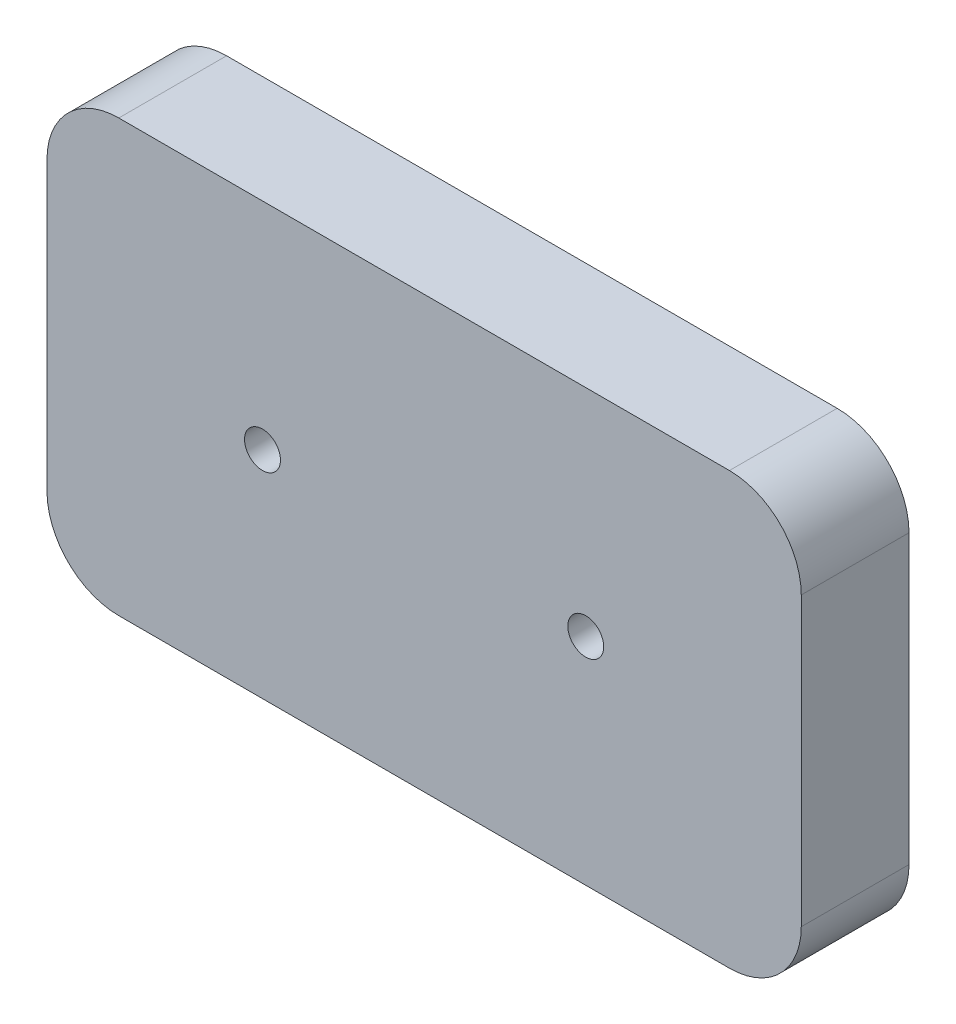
ISO-10303-21;
HEADER;
FILE_DESCRIPTION(('STEP AP214'),'2;1');
FILE_NAME('part.step','',(''),(''),'','','');
FILE_SCHEMA(('AUTOMOTIVE_DESIGN { 1 0 10303 214 1 1 1 1 }'));
ENDSEC;
DATA;
#1=APPLICATION_CONTEXT('core data for automotive mechanical design processes');
#2=APPLICATION_PROTOCOL_DEFINITION('international standard','automotive_design',2000,#1);
#3=PRODUCT_CONTEXT('',#1,'mechanical');
#4=PRODUCT('Part','Part','',(#3));
#5=PRODUCT_RELATED_PRODUCT_CATEGORY('part','',(#4));
#6=PRODUCT_DEFINITION_FORMATION('','',#4);
#7=PRODUCT_DEFINITION_CONTEXT('part definition',#1,'design');
#8=PRODUCT_DEFINITION('design','',#6,#7);
#9=PRODUCT_DEFINITION_SHAPE('','',#8);
#10=(LENGTH_UNIT() NAMED_UNIT(*) SI_UNIT(.MILLI.,.METRE.));
#11=(NAMED_UNIT(*) PLANE_ANGLE_UNIT() SI_UNIT($,.RADIAN.));
#12=(NAMED_UNIT(*) SI_UNIT($,.STERADIAN.) SOLID_ANGLE_UNIT());
#13=UNCERTAINTY_MEASURE_WITH_UNIT(LENGTH_MEASURE(1.E-05),#10,'distance_accuracy_value','');
#14=(GEOMETRIC_REPRESENTATION_CONTEXT(3) GLOBAL_UNCERTAINTY_ASSIGNED_CONTEXT((#13)) GLOBAL_UNIT_ASSIGNED_CONTEXT((#10,
#11,#12)) REPRESENTATION_CONTEXT('',''));
#15=CARTESIAN_POINT('',(0.,0.,0.));
#16=DIRECTION('',(0.,0.,1.));
#17=DIRECTION('',(1.,0.,0.));
#18=AXIS2_PLACEMENT_3D('',#15,#16,#17);
#19=CARTESIAN_POINT('',(-8.49999999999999,-4.,-3.));
#20=DIRECTION('',(0.,0.,1.));
#21=DIRECTION('',(1.,0.,0.));
#22=AXIS2_PLACEMENT_3D('',#19,#20,#21);
#23=CYLINDRICAL_SURFACE('',#22,2.);
#24=CARTESIAN_POINT('',(-8.49999999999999,-4.,0.));
#25=DIRECTION('',(0.,0.,1.));
#26=DIRECTION('',(-1.,0.,0.));
#27=AXIS2_PLACEMENT_3D('',#24,#25,#26);
#28=CIRCLE('',#27,2.);
#29=CARTESIAN_POINT('',(-10.5,-3.99999999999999,0.));
#30=VERTEX_POINT('',#29);
#31=CARTESIAN_POINT('',(-8.49999999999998,-6.,0.));
#32=VERTEX_POINT('',#31);
#33=EDGE_CURVE('E146',#30,#32,#28,.T.);
#34=ORIENTED_EDGE('',*,*,#33,.F.);
#35=DIRECTION('',(0.,0.,1.));
#36=VECTOR('',#35,1.);
#37=CARTESIAN_POINT('',(-10.5,-3.99999999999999,-3.));
#38=LINE('',#37,#36);
#39=CARTESIAN_POINT('',(-10.5,-3.99999999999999,-3.));
#40=VERTEX_POINT('',#39);
#41=EDGE_CURVE('E11',#40,#30,#38,.T.);
#42=ORIENTED_EDGE('',*,*,#41,.F.);
#43=CARTESIAN_POINT('',(-8.49999999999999,-4.,-3.));
#44=DIRECTION('',(0.,0.,1.));
#45=DIRECTION('',(-1.,0.,0.));
#46=AXIS2_PLACEMENT_3D('',#43,#44,#45);
#47=CIRCLE('',#46,2.);
#48=CARTESIAN_POINT('',(-8.49999999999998,-6.,-3.));
#49=VERTEX_POINT('',#48);
#50=EDGE_CURVE('E167',#40,#49,#47,.T.);
#51=ORIENTED_EDGE('',*,*,#50,.T.);
#52=DIRECTION('',(0.,0.,1.));
#53=VECTOR('',#52,1.);
#54=CARTESIAN_POINT('',(-8.49999999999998,-6.,-3.));
#55=LINE('',#54,#53);
#56=EDGE_CURVE('E39',#49,#32,#55,.T.);
#57=ORIENTED_EDGE('',*,*,#56,.T.);
#58=EDGE_LOOP('',(#34,#42,#51,#57));
#59=FACE_BOUND('',#58,.T.);
#60=ADVANCED_FACE('F36',(#59),#23,.T.);
#61=CARTESIAN_POINT('',(-10.5,-3.99999999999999,-3.));
#62=DIRECTION('',(-1.,0.,0.));
#63=DIRECTION('',(0.,0.,1.));
#64=AXIS2_PLACEMENT_3D('',#61,#62,#63);
#65=PLANE('',#64);
#66=DIRECTION('',(0.,-1.,0.));
#67=VECTOR('',#66,1.);
#68=CARTESIAN_POINT('',(-10.5,-3.99999999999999,0.));
#69=LINE('',#68,#67);
#70=CARTESIAN_POINT('',(-10.5,3.99999999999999,0.));
#71=VERTEX_POINT('',#70);
#72=EDGE_CURVE('E165',#71,#30,#69,.T.);
#73=ORIENTED_EDGE('',*,*,#72,.F.);
#74=DIRECTION('',(0.,0.,1.));
#75=VECTOR('',#74,1.);
#76=CARTESIAN_POINT('',(-10.5,3.99999999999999,-3.));
#77=LINE('',#76,#75);
#78=CARTESIAN_POINT('',(-10.5,3.99999999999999,-3.));
#79=VERTEX_POINT('',#78);
#80=EDGE_CURVE('E44',#79,#71,#77,.T.);
#81=ORIENTED_EDGE('',*,*,#80,.F.);
#82=DIRECTION('',(0.,-1.,0.));
#83=VECTOR('',#82,1.);
#84=CARTESIAN_POINT('',(-10.5,-3.99999999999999,-3.));
#85=LINE('',#84,#83);
#86=EDGE_CURVE('E136',#79,#40,#85,.T.);
#87=ORIENTED_EDGE('',*,*,#86,.T.);
#88=ORIENTED_EDGE('',*,*,#41,.T.);
#89=EDGE_LOOP('',(#73,#81,#87,#88));
#90=FACE_BOUND('',#89,.T.);
#91=ADVANCED_FACE('F179',(#90),#65,.T.);
#92=CARTESIAN_POINT('',(-8.49999999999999,4.,-3.));
#93=DIRECTION('',(0.,0.,1.));
#94=DIRECTION('',(1.,0.,0.));
#95=AXIS2_PLACEMENT_3D('',#92,#93,#94);
#96=CYLINDRICAL_SURFACE('',#95,2.);
#97=CARTESIAN_POINT('',(-8.49999999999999,4.,0.));
#98=DIRECTION('',(0.,0.,1.));
#99=DIRECTION('',(-1.,0.,0.));
#100=AXIS2_PLACEMENT_3D('',#97,#98,#99);
#101=CIRCLE('',#100,2.);
#102=CARTESIAN_POINT('',(-8.49999999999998,6.,0.));
#103=VERTEX_POINT('',#102);
#104=EDGE_CURVE('E123',#103,#71,#101,.T.);
#105=ORIENTED_EDGE('',*,*,#104,.F.);
#106=DIRECTION('',(0.,0.,1.));
#107=VECTOR('',#106,1.);
#108=CARTESIAN_POINT('',(-8.49999999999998,6.,-3.));
#109=LINE('',#108,#107);
#110=CARTESIAN_POINT('',(-8.49999999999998,6.,-3.));
#111=VERTEX_POINT('',#110);
#112=EDGE_CURVE('E117',#111,#103,#109,.T.);
#113=ORIENTED_EDGE('',*,*,#112,.F.);
#114=CARTESIAN_POINT('',(-8.49999999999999,4.,-3.));
#115=DIRECTION('',(0.,0.,1.));
#116=DIRECTION('',(-1.,0.,0.));
#117=AXIS2_PLACEMENT_3D('',#114,#115,#116);
#118=CIRCLE('',#117,2.);
#119=EDGE_CURVE('E120',#111,#79,#118,.T.);
#120=ORIENTED_EDGE('',*,*,#119,.T.);
#121=ORIENTED_EDGE('',*,*,#80,.T.);
#122=EDGE_LOOP('',(#105,#113,#120,#121));
#123=FACE_BOUND('',#122,.T.);
#124=ADVANCED_FACE('F119',(#123),#96,.T.);
#125=CARTESIAN_POINT('',(-8.49999999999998,6.,-3.));
#126=DIRECTION('',(0.,1.,0.));
#127=DIRECTION('',(0.,0.,1.));
#128=AXIS2_PLACEMENT_3D('',#125,#126,#127);
#129=PLANE('',#128);
#130=DIRECTION('',(-1.,0.,0.));
#131=VECTOR('',#130,1.);
#132=CARTESIAN_POINT('',(-8.49999999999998,6.,0.));
#133=LINE('',#132,#131);
#134=CARTESIAN_POINT('',(8.49999999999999,6.,0.));
#135=VERTEX_POINT('',#134);
#136=EDGE_CURVE('E162',#135,#103,#133,.T.);
#137=ORIENTED_EDGE('',*,*,#136,.F.);
#138=DIRECTION('',(0.,0.,1.));
#139=VECTOR('',#138,1.);
#140=CARTESIAN_POINT('',(8.49999999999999,6.,-3.));
#141=LINE('',#140,#139);
#142=CARTESIAN_POINT('',(8.49999999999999,6.,-3.));
#143=VERTEX_POINT('',#142);
#144=EDGE_CURVE('E128',#143,#135,#141,.T.);
#145=ORIENTED_EDGE('',*,*,#144,.F.);
#146=DIRECTION('',(-1.,0.,0.));
#147=VECTOR('',#146,1.);
#148=CARTESIAN_POINT('',(-8.49999999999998,6.,-3.));
#149=LINE('',#148,#147);
#150=EDGE_CURVE('E134',#143,#111,#149,.T.);
#151=ORIENTED_EDGE('',*,*,#150,.T.);
#152=ORIENTED_EDGE('',*,*,#112,.T.);
#153=EDGE_LOOP('',(#137,#145,#151,#152));
#154=FACE_BOUND('',#153,.T.);
#155=ADVANCED_FACE('F138',(#154),#129,.T.);
#156=CARTESIAN_POINT('',(8.50000000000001,4.,-3.));
#157=DIRECTION('',(0.,0.,1.));
#158=DIRECTION('',(1.,0.,0.));
#159=AXIS2_PLACEMENT_3D('',#156,#157,#158);
#160=CYLINDRICAL_SURFACE('',#159,2.);
#161=CARTESIAN_POINT('',(8.50000000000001,4.,0.));
#162=DIRECTION('',(0.,0.,1.));
#163=DIRECTION('',(-1.,0.,0.));
#164=AXIS2_PLACEMENT_3D('',#161,#162,#163);
#165=CIRCLE('',#164,2.);
#166=CARTESIAN_POINT('',(10.5,3.99999999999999,0.));
#167=VERTEX_POINT('',#166);
#168=EDGE_CURVE('E159',#167,#135,#165,.T.);
#169=ORIENTED_EDGE('',*,*,#168,.F.);
#170=DIRECTION('',(0.,0.,1.));
#171=VECTOR('',#170,1.);
#172=CARTESIAN_POINT('',(10.5,3.99999999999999,-3.));
#173=LINE('',#172,#171);
#174=CARTESIAN_POINT('',(10.5,3.99999999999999,-3.));
#175=VERTEX_POINT('',#174);
#176=EDGE_CURVE('E171',#175,#167,#173,.T.);
#177=ORIENTED_EDGE('',*,*,#176,.F.);
#178=CARTESIAN_POINT('',(8.50000000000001,4.,-3.));
#179=DIRECTION('',(0.,0.,1.));
#180=DIRECTION('',(-1.,0.,0.));
#181=AXIS2_PLACEMENT_3D('',#178,#179,#180);
#182=CIRCLE('',#181,2.);
#183=EDGE_CURVE('E139',#175,#143,#182,.T.);
#184=ORIENTED_EDGE('',*,*,#183,.T.);
#185=ORIENTED_EDGE('',*,*,#144,.T.);
#186=EDGE_LOOP('',(#169,#177,#184,#185));
#187=FACE_BOUND('',#186,.T.);
#188=ADVANCED_FACE('F192',(#187),#160,.T.);
#189=CARTESIAN_POINT('',(10.5,-3.99999999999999,-3.));
#190=DIRECTION('',(1.,0.,0.));
#191=DIRECTION('',(0.,0.,-1.));
#192=AXIS2_PLACEMENT_3D('',#189,#190,#191);
#193=PLANE('',#192);
#194=DIRECTION('',(0.,1.,0.));
#195=VECTOR('',#194,1.);
#196=CARTESIAN_POINT('',(10.5,-3.99999999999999,0.));
#197=LINE('',#196,#195);
#198=CARTESIAN_POINT('',(10.5,-3.99999999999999,0.));
#199=VERTEX_POINT('',#198);
#200=EDGE_CURVE('E156',#199,#167,#197,.T.);
#201=ORIENTED_EDGE('',*,*,#200,.F.);
#202=DIRECTION('',(0.,0.,1.));
#203=VECTOR('',#202,1.);
#204=CARTESIAN_POINT('',(10.5,-3.99999999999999,-3.));
#205=LINE('',#204,#203);
#206=CARTESIAN_POINT('',(10.5,-3.99999999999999,-3.));
#207=VERTEX_POINT('',#206);
#208=EDGE_CURVE('E173',#207,#199,#205,.T.);
#209=ORIENTED_EDGE('',*,*,#208,.F.);
#210=DIRECTION('',(0.,1.,0.));
#211=VECTOR('',#210,1.);
#212=CARTESIAN_POINT('',(10.5,-3.99999999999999,-3.));
#213=LINE('',#212,#211);
#214=EDGE_CURVE('E141',#207,#175,#213,.T.);
#215=ORIENTED_EDGE('',*,*,#214,.T.);
#216=ORIENTED_EDGE('',*,*,#176,.T.);
#217=EDGE_LOOP('',(#201,#209,#215,#216));
#218=FACE_BOUND('',#217,.T.);
#219=ADVANCED_FACE('F195',(#218),#193,.T.);
#220=CARTESIAN_POINT('',(8.50000000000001,-4.,-3.));
#221=DIRECTION('',(0.,0.,1.));
#222=DIRECTION('',(1.,0.,0.));
#223=AXIS2_PLACEMENT_3D('',#220,#221,#222);
#224=CYLINDRICAL_SURFACE('',#223,2.);
#225=CARTESIAN_POINT('',(8.50000000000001,-4.,0.));
#226=DIRECTION('',(0.,0.,1.));
#227=DIRECTION('',(1.,0.,0.));
#228=AXIS2_PLACEMENT_3D('',#225,#226,#227);
#229=CIRCLE('',#228,2.);
#230=CARTESIAN_POINT('',(8.49999999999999,-6.,0.));
#231=VERTEX_POINT('',#230);
#232=EDGE_CURVE('E153',#231,#199,#229,.T.);
#233=ORIENTED_EDGE('',*,*,#232,.F.);
#234=DIRECTION('',(0.,0.,1.));
#235=VECTOR('',#234,1.);
#236=CARTESIAN_POINT('',(8.49999999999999,-6.,-3.));
#237=LINE('',#236,#235);
#238=CARTESIAN_POINT('',(8.49999999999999,-6.,-3.));
#239=VERTEX_POINT('',#238);
#240=EDGE_CURVE('E174',#239,#231,#237,.T.);
#241=ORIENTED_EDGE('',*,*,#240,.F.);
#242=CARTESIAN_POINT('',(8.50000000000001,-4.,-3.));
#243=DIRECTION('',(0.,0.,1.));
#244=DIRECTION('',(1.,0.,0.));
#245=AXIS2_PLACEMENT_3D('',#242,#243,#244);
#246=CIRCLE('',#245,2.);
#247=EDGE_CURVE('E343',#239,#207,#246,.T.);
#248=ORIENTED_EDGE('',*,*,#247,.T.);
#249=ORIENTED_EDGE('',*,*,#208,.T.);
#250=EDGE_LOOP('',(#233,#241,#248,#249));
#251=FACE_BOUND('',#250,.T.);
#252=ADVANCED_FACE('F199',(#251),#224,.T.);
#253=CARTESIAN_POINT('',(-8.49999999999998,-6.,-3.));
#254=DIRECTION('',(0.,-1.,0.));
#255=DIRECTION('',(0.,0.,-1.));
#256=AXIS2_PLACEMENT_3D('',#253,#254,#255);
#257=PLANE('',#256);
#258=DIRECTION('',(1.,0.,0.));
#259=VECTOR('',#258,1.);
#260=CARTESIAN_POINT('',(-8.49999999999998,-6.,0.));
#261=LINE('',#260,#259);
#262=EDGE_CURVE('E149',#32,#231,#261,.T.);
#263=ORIENTED_EDGE('',*,*,#262,.F.);
#264=ORIENTED_EDGE('',*,*,#56,.F.);
#265=DIRECTION('',(1.,0.,0.));
#266=VECTOR('',#265,1.);
#267=CARTESIAN_POINT('',(-8.49999999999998,-6.,-3.));
#268=LINE('',#267,#266);
#269=EDGE_CURVE('E341',#49,#239,#268,.T.);
#270=ORIENTED_EDGE('',*,*,#269,.T.);
#271=ORIENTED_EDGE('',*,*,#240,.T.);
#272=EDGE_LOOP('',(#263,#264,#270,#271));
#273=FACE_BOUND('',#272,.T.);
#274=ADVANCED_FACE('F176',(#273),#257,.T.);
#275=CARTESIAN_POINT('',(-8.49999999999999,-4.,-3.));
#276=DIRECTION('',(0.,0.,-1.));
#277=DIRECTION('',(-1.,0.,0.));
#278=AXIS2_PLACEMENT_3D('',#275,#276,#277);
#279=PLANE('',#278);
#280=CARTESIAN_POINT('',(-8.5,4.,-3.));
#281=DIRECTION('',(0.,0.,-1.));
#282=DIRECTION('',(1.,0.,0.));
#283=AXIS2_PLACEMENT_3D('',#280,#281,#282);
#284=CIRCLE('',#283,1.);
#285=CARTESIAN_POINT('',(-9.5,3.99999999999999,-3.));
#286=VERTEX_POINT('',#285);
#287=CARTESIAN_POINT('',(-8.49999999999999,5.,-3.));
#288=VERTEX_POINT('',#287);
#289=EDGE_CURVE('E52',#286,#288,#284,.T.);
#290=ORIENTED_EDGE('',*,*,#289,.F.);
#291=DIRECTION('',(0.,1.,0.));
#292=VECTOR('',#291,1.);
#293=CARTESIAN_POINT('',(-9.5,-3.99999999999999,-3.));
#294=LINE('',#293,#292);
#295=CARTESIAN_POINT('',(-9.5,-3.99999999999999,-3.));
#296=VERTEX_POINT('',#295);
#297=EDGE_CURVE('E277',#296,#286,#294,.T.);
#298=ORIENTED_EDGE('',*,*,#297,.F.);
#299=CARTESIAN_POINT('',(-8.5,-4.,-3.));
#300=DIRECTION('',(0.,0.,-1.));
#301=DIRECTION('',(-1.,0.,0.));
#302=AXIS2_PLACEMENT_3D('',#299,#300,#301);
#303=CIRCLE('',#302,1.);
#304=CARTESIAN_POINT('',(-8.49999999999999,-5.,-3.));
#305=VERTEX_POINT('',#304);
#306=EDGE_CURVE('E315',#305,#296,#303,.T.);
#307=ORIENTED_EDGE('',*,*,#306,.F.);
#308=DIRECTION('',(-1.,0.,0.));
#309=VECTOR('',#308,1.);
#310=CARTESIAN_POINT('',(8.49999999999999,-5.,-3.));
#311=LINE('',#310,#309);
#312=CARTESIAN_POINT('',(8.49999999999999,-5.,-3.));
#313=VERTEX_POINT('',#312);
#314=EDGE_CURVE('E312',#313,#305,#311,.T.);
#315=ORIENTED_EDGE('',*,*,#314,.F.);
#316=CARTESIAN_POINT('',(8.5,-4.,-3.));
#317=DIRECTION('',(0.,0.,-1.));
#318=DIRECTION('',(1.,0.,0.));
#319=AXIS2_PLACEMENT_3D('',#316,#317,#318);
#320=CIRCLE('',#319,1.);
#321=CARTESIAN_POINT('',(9.5,-3.99999999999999,-3.));
#322=VERTEX_POINT('',#321);
#323=EDGE_CURVE('E309',#322,#313,#320,.T.);
#324=ORIENTED_EDGE('',*,*,#323,.F.);
#325=DIRECTION('',(0.,-1.,0.));
#326=VECTOR('',#325,1.);
#327=CARTESIAN_POINT('',(9.5,-3.99999999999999,-3.));
#328=LINE('',#327,#326);
#329=CARTESIAN_POINT('',(9.5,3.99999999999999,-3.));
#330=VERTEX_POINT('',#329);
#331=EDGE_CURVE('E306',#330,#322,#328,.T.);
#332=ORIENTED_EDGE('',*,*,#331,.F.);
#333=CARTESIAN_POINT('',(8.5,4.,-3.));
#334=DIRECTION('',(0.,0.,-1.));
#335=DIRECTION('',(1.,0.,0.));
#336=AXIS2_PLACEMENT_3D('',#333,#334,#335);
#337=CIRCLE('',#336,1.);
#338=CARTESIAN_POINT('',(8.49999999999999,5.,-3.));
#339=VERTEX_POINT('',#338);
#340=EDGE_CURVE('E303',#339,#330,#337,.T.);
#341=ORIENTED_EDGE('',*,*,#340,.F.);
#342=DIRECTION('',(1.,0.,0.));
#343=VECTOR('',#342,1.);
#344=CARTESIAN_POINT('',(8.49999999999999,5.,-3.));
#345=LINE('',#344,#343);
#346=EDGE_CURVE('E300',#288,#339,#345,.T.);
#347=ORIENTED_EDGE('',*,*,#346,.F.);
#348=EDGE_LOOP('',(#290,#298,#307,#315,#324,#332,#341,#347));
#349=FACE_BOUND('',#348,.T.);
#350=ORIENTED_EDGE('',*,*,#50,.F.);
#351=ORIENTED_EDGE('',*,*,#86,.F.);
#352=ORIENTED_EDGE('',*,*,#119,.F.);
#353=ORIENTED_EDGE('',*,*,#150,.F.);
#354=ORIENTED_EDGE('',*,*,#183,.F.);
#355=ORIENTED_EDGE('',*,*,#214,.F.);
#356=ORIENTED_EDGE('',*,*,#247,.F.);
#357=ORIENTED_EDGE('',*,*,#269,.F.);
#358=EDGE_LOOP('',(#350,#351,#352,#353,#354,#355,#356,#357));
#359=FACE_BOUND('',#358,.T.);
#360=ADVANCED_FACE('F132',(#349,#359),#279,.T.);
#361=CARTESIAN_POINT('',(-8.49999999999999,-4.,0.));
#362=DIRECTION('',(0.,0.,-1.));
#363=DIRECTION('',(-1.,0.,0.));
#364=AXIS2_PLACEMENT_3D('',#361,#362,#363);
#365=PLANE('',#364);
#366=CARTESIAN_POINT('',(4.5,0.,0.));
#367=DIRECTION('',(0.,0.,-1.));
#368=DIRECTION('',(-1.,0.,0.));
#369=AXIS2_PLACEMENT_3D('',#366,#367,#368);
#370=CIRCLE('',#369,0.500000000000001);
#371=CARTESIAN_POINT('',(4.,0.,0.));
#372=VERTEX_POINT('',#371);
#373=EDGE_CURVE('E260',#372,#372,#370,.T.);
#374=ORIENTED_EDGE('',*,*,#373,.T.);
#375=EDGE_LOOP('',(#374));
#376=FACE_BOUND('',#375,.T.);
#377=CARTESIAN_POINT('',(-4.5,0.,0.));
#378=DIRECTION('',(0.,0.,-1.));
#379=DIRECTION('',(-1.,0.,0.));
#380=AXIS2_PLACEMENT_3D('',#377,#378,#379);
#381=CIRCLE('',#380,0.500000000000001);
#382=CARTESIAN_POINT('',(-5.,0.,0.));
#383=VERTEX_POINT('',#382);
#384=EDGE_CURVE('E268',#383,#383,#381,.T.);
#385=ORIENTED_EDGE('',*,*,#384,.T.);
#386=EDGE_LOOP('',(#385));
#387=FACE_BOUND('',#386,.T.);
#388=ORIENTED_EDGE('',*,*,#33,.T.);
#389=ORIENTED_EDGE('',*,*,#262,.T.);
#390=ORIENTED_EDGE('',*,*,#232,.T.);
#391=ORIENTED_EDGE('',*,*,#200,.T.);
#392=ORIENTED_EDGE('',*,*,#168,.T.);
#393=ORIENTED_EDGE('',*,*,#136,.T.);
#394=ORIENTED_EDGE('',*,*,#104,.T.);
#395=ORIENTED_EDGE('',*,*,#72,.T.);
#396=EDGE_LOOP('',(#388,#389,#390,#391,#392,#393,#394,#395));
#397=FACE_BOUND('',#396,.T.);
#398=ADVANCED_FACE('F178',(#376,#387,#397),#365,.F.);
#399=CARTESIAN_POINT('',(-8.5,4.,-1.3));
#400=DIRECTION('',(0.,0.,-1.));
#401=DIRECTION('',(-1.,0.,0.));
#402=AXIS2_PLACEMENT_3D('',#399,#400,#401);
#403=CYLINDRICAL_SURFACE('',#402,1.);
#404=ORIENTED_EDGE('',*,*,#289,.T.);
#405=DIRECTION('',(0.,0.,-1.));
#406=VECTOR('',#405,1.);
#407=CARTESIAN_POINT('',(-8.49999999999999,5.,-1.3));
#408=LINE('',#407,#406);
#409=CARTESIAN_POINT('',(-8.49999999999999,5.,-1.3));
#410=VERTEX_POINT('',#409);
#411=EDGE_CURVE('E298',#410,#288,#408,.T.);
#412=ORIENTED_EDGE('',*,*,#411,.F.);
#413=CARTESIAN_POINT('',(-8.5,4.,-1.3));
#414=DIRECTION('',(0.,0.,-1.));
#415=DIRECTION('',(1.,0.,0.));
#416=AXIS2_PLACEMENT_3D('',#413,#414,#415);
#417=CIRCLE('',#416,1.);
#418=CARTESIAN_POINT('',(-9.5,3.99999999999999,-1.3));
#419=VERTEX_POINT('',#418);
#420=EDGE_CURVE('E273',#419,#410,#417,.T.);
#421=ORIENTED_EDGE('',*,*,#420,.F.);
#422=DIRECTION('',(0.,0.,-1.));
#423=VECTOR('',#422,1.);
#424=CARTESIAN_POINT('',(-9.5,3.99999999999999,-1.3));
#425=LINE('',#424,#423);
#426=EDGE_CURVE('E150',#419,#286,#425,.T.);
#427=ORIENTED_EDGE('',*,*,#426,.T.);
#428=EDGE_LOOP('',(#404,#412,#421,#427));
#429=FACE_BOUND('',#428,.T.);
#430=ADVANCED_FACE('F211',(#429),#403,.F.);
#431=CARTESIAN_POINT('',(-9.5,-3.99999999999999,-1.3));
#432=DIRECTION('',(-1.,0.,0.));
#433=DIRECTION('',(0.,0.,1.));
#434=AXIS2_PLACEMENT_3D('',#431,#432,#433);
#435=PLANE('',#434);
#436=ORIENTED_EDGE('',*,*,#297,.T.);
#437=ORIENTED_EDGE('',*,*,#426,.F.);
#438=DIRECTION('',(0.,1.,0.));
#439=VECTOR('',#438,1.);
#440=CARTESIAN_POINT('',(-9.5,-3.99999999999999,-1.3));
#441=LINE('',#440,#439);
#442=CARTESIAN_POINT('',(-9.5,-3.99999999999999,-1.3));
#443=VERTEX_POINT('',#442);
#444=EDGE_CURVE('E295',#443,#419,#441,.T.);
#445=ORIENTED_EDGE('',*,*,#444,.F.);
#446=DIRECTION('',(0.,0.,-1.));
#447=VECTOR('',#446,1.);
#448=CARTESIAN_POINT('',(-9.5,-3.99999999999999,-1.3));
#449=LINE('',#448,#447);
#450=EDGE_CURVE('E321',#443,#296,#449,.T.);
#451=ORIENTED_EDGE('',*,*,#450,.T.);
#452=EDGE_LOOP('',(#436,#437,#445,#451));
#453=FACE_BOUND('',#452,.T.);
#454=ADVANCED_FACE('F216',(#453),#435,.F.);
#455=CARTESIAN_POINT('',(-8.5,-4.,-1.3));
#456=DIRECTION('',(0.,0.,-1.));
#457=DIRECTION('',(-1.,0.,0.));
#458=AXIS2_PLACEMENT_3D('',#455,#456,#457);
#459=CYLINDRICAL_SURFACE('',#458,1.);
#460=ORIENTED_EDGE('',*,*,#306,.T.);
#461=ORIENTED_EDGE('',*,*,#450,.F.);
#462=CARTESIAN_POINT('',(-8.5,-4.,-1.3));
#463=DIRECTION('',(0.,0.,-1.));
#464=DIRECTION('',(-1.,0.,0.));
#465=AXIS2_PLACEMENT_3D('',#462,#463,#464);
#466=CIRCLE('',#465,1.);
#467=CARTESIAN_POINT('',(-8.49999999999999,-5.,-1.3));
#468=VERTEX_POINT('',#467);
#469=EDGE_CURVE('E292',#468,#443,#466,.T.);
#470=ORIENTED_EDGE('',*,*,#469,.F.);
#471=DIRECTION('',(0.,0.,-1.));
#472=VECTOR('',#471,1.);
#473=CARTESIAN_POINT('',(-8.49999999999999,-5.,-1.3));
#474=LINE('',#473,#472);
#475=EDGE_CURVE('E324',#468,#305,#474,.T.);
#476=ORIENTED_EDGE('',*,*,#475,.T.);
#477=EDGE_LOOP('',(#460,#461,#470,#476));
#478=FACE_BOUND('',#477,.T.);
#479=ADVANCED_FACE('F237',(#478),#459,.F.);
#480=CARTESIAN_POINT('',(8.49999999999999,-5.,-1.3));
#481=DIRECTION('',(0.,-1.,0.));
#482=DIRECTION('',(0.,0.,-1.));
#483=AXIS2_PLACEMENT_3D('',#480,#481,#482);
#484=PLANE('',#483);
#485=ORIENTED_EDGE('',*,*,#314,.T.);
#486=ORIENTED_EDGE('',*,*,#475,.F.);
#487=DIRECTION('',(-1.,0.,0.));
#488=VECTOR('',#487,1.);
#489=CARTESIAN_POINT('',(8.49999999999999,-5.,-1.3));
#490=LINE('',#489,#488);
#491=CARTESIAN_POINT('',(8.49999999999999,-5.,-1.3));
#492=VERTEX_POINT('',#491);
#493=EDGE_CURVE('E289',#492,#468,#490,.T.);
#494=ORIENTED_EDGE('',*,*,#493,.F.);
#495=DIRECTION('',(0.,0.,-1.));
#496=VECTOR('',#495,1.);
#497=CARTESIAN_POINT('',(8.49999999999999,-5.,-1.3));
#498=LINE('',#497,#496);
#499=EDGE_CURVE('E327',#492,#313,#498,.T.);
#500=ORIENTED_EDGE('',*,*,#499,.T.);
#501=EDGE_LOOP('',(#485,#486,#494,#500));
#502=FACE_BOUND('',#501,.T.);
#503=ADVANCED_FACE('F233',(#502),#484,.F.);
#504=CARTESIAN_POINT('',(8.5,-4.,-1.3));
#505=DIRECTION('',(0.,0.,-1.));
#506=DIRECTION('',(-1.,0.,0.));
#507=AXIS2_PLACEMENT_3D('',#504,#505,#506);
#508=CYLINDRICAL_SURFACE('',#507,1.);
#509=ORIENTED_EDGE('',*,*,#323,.T.);
#510=ORIENTED_EDGE('',*,*,#499,.F.);
#511=CARTESIAN_POINT('',(8.5,-4.,-1.3));
#512=DIRECTION('',(0.,0.,-1.));
#513=DIRECTION('',(1.,0.,0.));
#514=AXIS2_PLACEMENT_3D('',#511,#512,#513);
#515=CIRCLE('',#514,1.);
#516=CARTESIAN_POINT('',(9.5,-3.99999999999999,-1.3));
#517=VERTEX_POINT('',#516);
#518=EDGE_CURVE('E286',#517,#492,#515,.T.);
#519=ORIENTED_EDGE('',*,*,#518,.F.);
#520=DIRECTION('',(0.,0.,-1.));
#521=VECTOR('',#520,1.);
#522=CARTESIAN_POINT('',(9.5,-3.99999999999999,-1.3));
#523=LINE('',#522,#521);
#524=EDGE_CURVE('E330',#517,#322,#523,.T.);
#525=ORIENTED_EDGE('',*,*,#524,.T.);
#526=EDGE_LOOP('',(#509,#510,#519,#525));
#527=FACE_BOUND('',#526,.T.);
#528=ADVANCED_FACE('F229',(#527),#508,.F.);
#529=CARTESIAN_POINT('',(9.5,-3.99999999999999,-1.3));
#530=DIRECTION('',(1.,0.,0.));
#531=DIRECTION('',(0.,0.,-1.));
#532=AXIS2_PLACEMENT_3D('',#529,#530,#531);
#533=PLANE('',#532);
#534=ORIENTED_EDGE('',*,*,#331,.T.);
#535=ORIENTED_EDGE('',*,*,#524,.F.);
#536=DIRECTION('',(0.,-1.,0.));
#537=VECTOR('',#536,1.);
#538=CARTESIAN_POINT('',(9.5,-3.99999999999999,-1.3));
#539=LINE('',#538,#537);
#540=CARTESIAN_POINT('',(9.5,3.99999999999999,-1.3));
#541=VERTEX_POINT('',#540);
#542=EDGE_CURVE('E283',#541,#517,#539,.T.);
#543=ORIENTED_EDGE('',*,*,#542,.F.);
#544=DIRECTION('',(0.,0.,-1.));
#545=VECTOR('',#544,1.);
#546=CARTESIAN_POINT('',(9.5,3.99999999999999,-1.3));
#547=LINE('',#546,#545);
#548=EDGE_CURVE('E333',#541,#330,#547,.T.);
#549=ORIENTED_EDGE('',*,*,#548,.T.);
#550=EDGE_LOOP('',(#534,#535,#543,#549));
#551=FACE_BOUND('',#550,.T.);
#552=ADVANCED_FACE('F225',(#551),#533,.F.);
#553=CARTESIAN_POINT('',(8.5,4.,-1.3));
#554=DIRECTION('',(0.,0.,-1.));
#555=DIRECTION('',(-1.,0.,0.));
#556=AXIS2_PLACEMENT_3D('',#553,#554,#555);
#557=CYLINDRICAL_SURFACE('',#556,1.);
#558=ORIENTED_EDGE('',*,*,#340,.T.);
#559=ORIENTED_EDGE('',*,*,#548,.F.);
#560=CARTESIAN_POINT('',(8.5,4.,-1.3));
#561=DIRECTION('',(0.,0.,-1.));
#562=DIRECTION('',(1.,0.,0.));
#563=AXIS2_PLACEMENT_3D('',#560,#561,#562);
#564=CIRCLE('',#563,1.);
#565=CARTESIAN_POINT('',(8.49999999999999,5.,-1.3));
#566=VERTEX_POINT('',#565);
#567=EDGE_CURVE('E280',#566,#541,#564,.T.);
#568=ORIENTED_EDGE('',*,*,#567,.F.);
#569=DIRECTION('',(0.,0.,-1.));
#570=VECTOR('',#569,1.);
#571=CARTESIAN_POINT('',(8.49999999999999,5.,-1.3));
#572=LINE('',#571,#570);
#573=EDGE_CURVE('E336',#566,#339,#572,.T.);
#574=ORIENTED_EDGE('',*,*,#573,.T.);
#575=EDGE_LOOP('',(#558,#559,#568,#574));
#576=FACE_BOUND('',#575,.T.);
#577=ADVANCED_FACE('F221',(#576),#557,.F.);
#578=CARTESIAN_POINT('',(8.49999999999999,5.,-1.3));
#579=DIRECTION('',(0.,1.,0.));
#580=DIRECTION('',(0.,0.,1.));
#581=AXIS2_PLACEMENT_3D('',#578,#579,#580);
#582=PLANE('',#581);
#583=ORIENTED_EDGE('',*,*,#346,.T.);
#584=ORIENTED_EDGE('',*,*,#573,.F.);
#585=DIRECTION('',(1.,0.,0.));
#586=VECTOR('',#585,1.);
#587=CARTESIAN_POINT('',(8.49999999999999,5.,-1.3));
#588=LINE('',#587,#586);
#589=EDGE_CURVE('E276',#410,#566,#588,.T.);
#590=ORIENTED_EDGE('',*,*,#589,.F.);
#591=ORIENTED_EDGE('',*,*,#411,.T.);
#592=EDGE_LOOP('',(#583,#584,#590,#591));
#593=FACE_BOUND('',#592,.T.);
#594=ADVANCED_FACE('F217',(#593),#582,.F.);
#595=CARTESIAN_POINT('',(-8.5,4.,-1.3));
#596=DIRECTION('',(0.,0.,1.));
#597=DIRECTION('',(1.,0.,0.));
#598=AXIS2_PLACEMENT_3D('',#595,#596,#597);
#599=PLANE('',#598);
#600=CARTESIAN_POINT('',(4.5,0.,-1.3));
#601=DIRECTION('',(0.,0.,-1.));
#602=DIRECTION('',(-1.,0.,0.));
#603=AXIS2_PLACEMENT_3D('',#600,#601,#602);
#604=CIRCLE('',#603,0.500000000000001);
#605=CARTESIAN_POINT('',(4.,0.,-1.3));
#606=VERTEX_POINT('',#605);
#607=EDGE_CURVE('E263',#606,#606,#604,.T.);
#608=ORIENTED_EDGE('',*,*,#607,.F.);
#609=EDGE_LOOP('',(#608));
#610=FACE_BOUND('',#609,.T.);
#611=CARTESIAN_POINT('',(-4.5,0.,-1.3));
#612=DIRECTION('',(0.,0.,-1.));
#613=DIRECTION('',(-1.,0.,0.));
#614=AXIS2_PLACEMENT_3D('',#611,#612,#613);
#615=CIRCLE('',#614,0.500000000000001);
#616=CARTESIAN_POINT('',(-5.,0.,-1.3));
#617=VERTEX_POINT('',#616);
#618=EDGE_CURVE('E265',#617,#617,#615,.T.);
#619=ORIENTED_EDGE('',*,*,#618,.F.);
#620=EDGE_LOOP('',(#619));
#621=FACE_BOUND('',#620,.T.);
#622=ORIENTED_EDGE('',*,*,#420,.T.);
#623=ORIENTED_EDGE('',*,*,#589,.T.);
#624=ORIENTED_EDGE('',*,*,#567,.T.);
#625=ORIENTED_EDGE('',*,*,#542,.T.);
#626=ORIENTED_EDGE('',*,*,#518,.T.);
#627=ORIENTED_EDGE('',*,*,#493,.T.);
#628=ORIENTED_EDGE('',*,*,#469,.T.);
#629=ORIENTED_EDGE('',*,*,#444,.T.);
#630=EDGE_LOOP('',(#622,#623,#624,#625,#626,#627,#628,#629));
#631=FACE_BOUND('',#630,.T.);
#632=ADVANCED_FACE('F220',(#610,#621,#631),#599,.F.);
#633=CARTESIAN_POINT('',(-4.5,0.,0.));
#634=DIRECTION('',(0.,0.,-1.));
#635=DIRECTION('',(-1.,0.,0.));
#636=AXIS2_PLACEMENT_3D('',#633,#634,#635);
#637=CYLINDRICAL_SURFACE('',#636,0.500000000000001);
#638=ORIENTED_EDGE('',*,*,#384,.F.);
#639=EDGE_LOOP('',(#638));
#640=FACE_BOUND('',#639,.T.);
#641=ORIENTED_EDGE('',*,*,#618,.T.);
#642=EDGE_LOOP('',(#641));
#643=FACE_BOUND('',#642,.T.);
#644=ADVANCED_FACE('F247',(#640,#643),#637,.F.);
#645=CARTESIAN_POINT('',(4.5,0.,0.));
#646=DIRECTION('',(0.,0.,-1.));
#647=DIRECTION('',(-1.,0.,0.));
#648=AXIS2_PLACEMENT_3D('',#645,#646,#647);
#649=CYLINDRICAL_SURFACE('',#648,0.500000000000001);
#650=ORIENTED_EDGE('',*,*,#373,.F.);
#651=EDGE_LOOP('',(#650));
#652=FACE_BOUND('',#651,.T.);
#653=ORIENTED_EDGE('',*,*,#607,.T.);
#654=EDGE_LOOP('',(#653));
#655=FACE_BOUND('',#654,.T.);
#656=ADVANCED_FACE('F251',(#652,#655),#649,.F.);
#657=CLOSED_SHELL('',(#60,#91,#124,#155,#188,#219,#252,#274,#360,#398,#430,#454,#479,#503,#528,
#552,#577,#594,#632,#644,#656));
#658=MANIFOLD_SOLID_BREP('B2',#657);
#659=ADVANCED_BREP_SHAPE_REPRESENTATION('',(#18,#658),#14);
#660=SHAPE_DEFINITION_REPRESENTATION(#9,#659);
ENDSEC;
END-ISO-10303-21;
